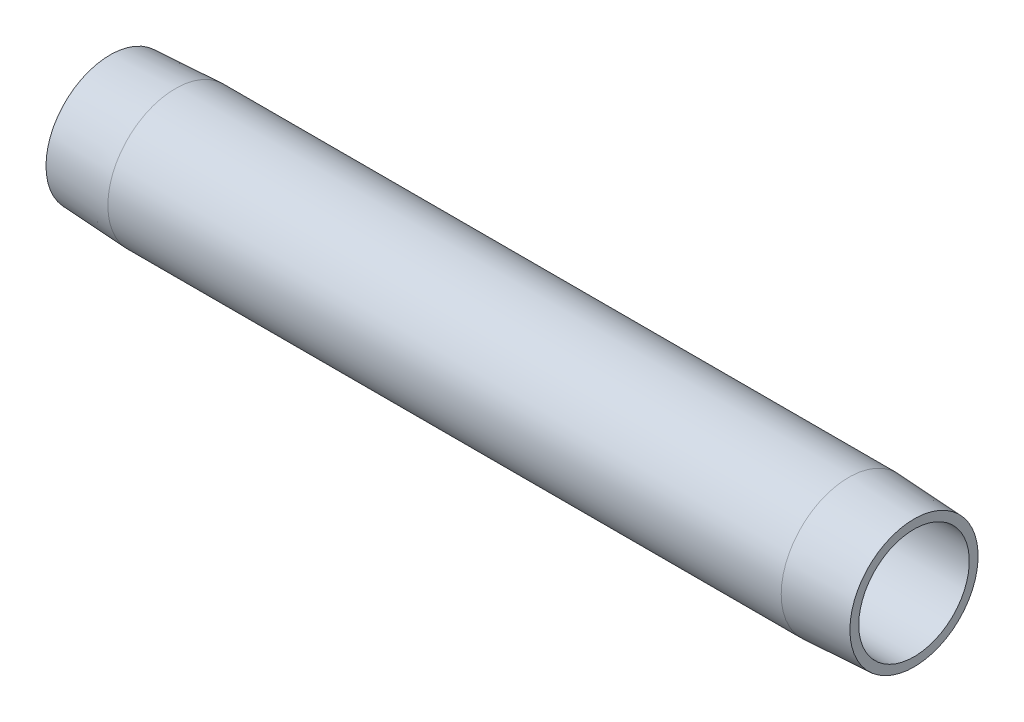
ISO-10303-21;
HEADER;
FILE_DESCRIPTION(('STEP AP214'),'2;1');
FILE_NAME('part.step','',(''),(''),'','','');
FILE_SCHEMA(('AUTOMOTIVE_DESIGN { 1 0 10303 214 1 1 1 1 }'));
ENDSEC;
DATA;
#1=APPLICATION_CONTEXT('core data for automotive mechanical design processes');
#2=APPLICATION_PROTOCOL_DEFINITION('international standard','automotive_design',2000,#1);
#3=PRODUCT_CONTEXT('',#1,'mechanical');
#4=PRODUCT('Part','Part','',(#3));
#5=PRODUCT_RELATED_PRODUCT_CATEGORY('part','',(#4));
#6=PRODUCT_DEFINITION_FORMATION('','',#4);
#7=PRODUCT_DEFINITION_CONTEXT('part definition',#1,'design');
#8=PRODUCT_DEFINITION('design','',#6,#7);
#9=PRODUCT_DEFINITION_SHAPE('','',#8);
#10=(LENGTH_UNIT() NAMED_UNIT(*) SI_UNIT(.MILLI.,.METRE.));
#11=(NAMED_UNIT(*) PLANE_ANGLE_UNIT() SI_UNIT($,.RADIAN.));
#12=(NAMED_UNIT(*) SI_UNIT($,.STERADIAN.) SOLID_ANGLE_UNIT());
#13=UNCERTAINTY_MEASURE_WITH_UNIT(LENGTH_MEASURE(1.E-05),#10,'distance_accuracy_value','');
#14=(GEOMETRIC_REPRESENTATION_CONTEXT(3) GLOBAL_UNCERTAINTY_ASSIGNED_CONTEXT((#13)) GLOBAL_UNIT_ASSIGNED_CONTEXT((#10,
#11,#12)) REPRESENTATION_CONTEXT('',''));
#15=CARTESIAN_POINT('',(0.,0.,0.));
#16=DIRECTION('',(0.,0.,1.));
#17=DIRECTION('',(1.,0.,0.));
#18=AXIS2_PLACEMENT_3D('',#15,#16,#17);
#19=CARTESIAN_POINT('',(127.,8.73125,0.));
#20=DIRECTION('',(-1.,0.,0.));
#21=DIRECTION('',(0.,0.,1.));
#22=AXIS2_PLACEMENT_3D('',#19,#20,#21);
#23=PLANE('',#22);
#24=CARTESIAN_POINT('',(127.,0.,0.));
#25=DIRECTION('',(-1.,0.,0.));
#26=DIRECTION('',(0.,0.,1.));
#27=AXIS2_PLACEMENT_3D('',#24,#25,#26);
#28=CIRCLE('',#27,10.1275500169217);
#29=CARTESIAN_POINT('',(127.,0.,10.1275500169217));
#30=VERTEX_POINT('',#29);
#31=EDGE_CURVE('E10',#30,#30,#28,.T.);
#32=ORIENTED_EDGE('',*,*,#31,.F.);
#33=EDGE_LOOP('',(#32));
#34=FACE_BOUND('',#33,.T.);
#35=CARTESIAN_POINT('',(127.,0.,0.));
#36=DIRECTION('',(-1.,0.,0.));
#37=DIRECTION('',(0.,0.,1.));
#38=AXIS2_PLACEMENT_3D('',#35,#36,#37);
#39=CIRCLE('',#38,8.73125);
#40=CARTESIAN_POINT('',(127.,0.,8.73125));
#41=VERTEX_POINT('',#40);
#42=EDGE_CURVE('E52',#41,#41,#39,.T.);
#43=ORIENTED_EDGE('',*,*,#42,.T.);
#44=EDGE_LOOP('',(#43));
#45=FACE_BOUND('',#44,.T.);
#46=ADVANCED_FACE('F30',(#34,#45),#23,.F.);
#47=CARTESIAN_POINT('',(127.,0.,0.));
#48=DIRECTION('',(-1.,0.,0.));
#49=DIRECTION('',(0.,0.,1.));
#50=AXIS2_PLACEMENT_3D('',#47,#48,#49);
#51=CONICAL_SURFACE('',#50,10.1275500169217,0.0523598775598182);
#52=CARTESIAN_POINT('',(116.6876,0.,0.));
#53=DIRECTION('',(-1.,0.,0.));
#54=DIRECTION('',(0.,0.,1.));
#55=AXIS2_PLACEMENT_3D('',#52,#53,#54);
#56=CIRCLE('',#55,10.668);
#57=CARTESIAN_POINT('',(116.6876,0.,10.668));
#58=VERTEX_POINT('',#57);
#59=EDGE_CURVE('E36',#58,#58,#56,.T.);
#60=ORIENTED_EDGE('',*,*,#59,.F.);
#61=EDGE_LOOP('',(#60));
#62=FACE_BOUND('',#61,.T.);
#63=ORIENTED_EDGE('',*,*,#31,.T.);
#64=EDGE_LOOP('',(#63));
#65=FACE_BOUND('',#64,.T.);
#66=ADVANCED_FACE('F77',(#62,#65),#51,.T.);
#67=CARTESIAN_POINT('',(0.,0.,0.));
#68=DIRECTION('',(-1.,0.,0.));
#69=DIRECTION('',(0.,0.,1.));
#70=AXIS2_PLACEMENT_3D('',#67,#68,#69);
#71=CYLINDRICAL_SURFACE('',#70,10.668);
#72=CARTESIAN_POINT('',(10.3124,0.,0.));
#73=DIRECTION('',(-1.,0.,0.));
#74=DIRECTION('',(0.,0.,1.));
#75=AXIS2_PLACEMENT_3D('',#72,#73,#74);
#76=CIRCLE('',#75,10.668);
#77=CARTESIAN_POINT('',(10.3124,0.,10.668));
#78=VERTEX_POINT('',#77);
#79=EDGE_CURVE('E40',#78,#78,#76,.T.);
#80=ORIENTED_EDGE('',*,*,#79,.F.);
#81=EDGE_LOOP('',(#80));
#82=FACE_BOUND('',#81,.T.);
#83=ORIENTED_EDGE('',*,*,#59,.T.);
#84=EDGE_LOOP('',(#83));
#85=FACE_BOUND('',#84,.T.);
#86=ADVANCED_FACE('F72',(#82,#85),#71,.T.);
#87=CARTESIAN_POINT('',(10.3124,0.,0.));
#88=DIRECTION('',(1.,0.,0.));
#89=DIRECTION('',(0.,0.,-1.));
#90=AXIS2_PLACEMENT_3D('',#87,#88,#89);
#91=CONICAL_SURFACE('',#90,10.668,0.0523598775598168);
#92=CARTESIAN_POINT('',(0.,0.,0.));
#93=DIRECTION('',(-1.,0.,0.));
#94=DIRECTION('',(0.,0.,1.));
#95=AXIS2_PLACEMENT_3D('',#92,#93,#94);
#96=CIRCLE('',#95,10.1275500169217);
#97=CARTESIAN_POINT('',(0.,0.,10.1275500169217));
#98=VERTEX_POINT('',#97);
#99=EDGE_CURVE('E44',#98,#98,#96,.T.);
#100=ORIENTED_EDGE('',*,*,#99,.F.);
#101=EDGE_LOOP('',(#100));
#102=FACE_BOUND('',#101,.T.);
#103=ORIENTED_EDGE('',*,*,#79,.T.);
#104=EDGE_LOOP('',(#103));
#105=FACE_BOUND('',#104,.T.);
#106=ADVANCED_FACE('F66',(#102,#105),#91,.T.);
#107=CARTESIAN_POINT('',(0.,10.1275500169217,0.));
#108=DIRECTION('',(1.,0.,0.));
#109=DIRECTION('',(0.,0.,-1.));
#110=AXIS2_PLACEMENT_3D('',#107,#108,#109);
#111=PLANE('',#110);
#112=CARTESIAN_POINT('',(0.,0.,0.));
#113=DIRECTION('',(-1.,0.,0.));
#114=DIRECTION('',(0.,0.,1.));
#115=AXIS2_PLACEMENT_3D('',#112,#113,#114);
#116=CIRCLE('',#115,8.73125);
#117=CARTESIAN_POINT('',(0.,0.,8.73125));
#118=VERTEX_POINT('',#117);
#119=EDGE_CURVE('E49',#118,#118,#116,.T.);
#120=ORIENTED_EDGE('',*,*,#119,.F.);
#121=EDGE_LOOP('',(#120));
#122=FACE_BOUND('',#121,.T.);
#123=ORIENTED_EDGE('',*,*,#99,.T.);
#124=EDGE_LOOP('',(#123));
#125=FACE_BOUND('',#124,.T.);
#126=ADVANCED_FACE('F60',(#122,#125),#111,.F.);
#127=CARTESIAN_POINT('',(0.,0.,0.));
#128=DIRECTION('',(-1.,0.,0.));
#129=DIRECTION('',(0.,0.,1.));
#130=AXIS2_PLACEMENT_3D('',#127,#128,#129);
#131=CYLINDRICAL_SURFACE('',#130,8.73125);
#132=ORIENTED_EDGE('',*,*,#42,.F.);
#133=EDGE_LOOP('',(#132));
#134=FACE_BOUND('',#133,.T.);
#135=ORIENTED_EDGE('',*,*,#119,.T.);
#136=EDGE_LOOP('',(#135));
#137=FACE_BOUND('',#136,.T.);
#138=ADVANCED_FACE('F57',(#134,#137),#131,.F.);
#139=CLOSED_SHELL('',(#46,#66,#86,#106,#126,#138));
#140=MANIFOLD_SOLID_BREP('B2',#139);
#141=ADVANCED_BREP_SHAPE_REPRESENTATION('',(#18,#140),#14);
#142=SHAPE_DEFINITION_REPRESENTATION(#9,#141);
ENDSEC;
END-ISO-10303-21;
